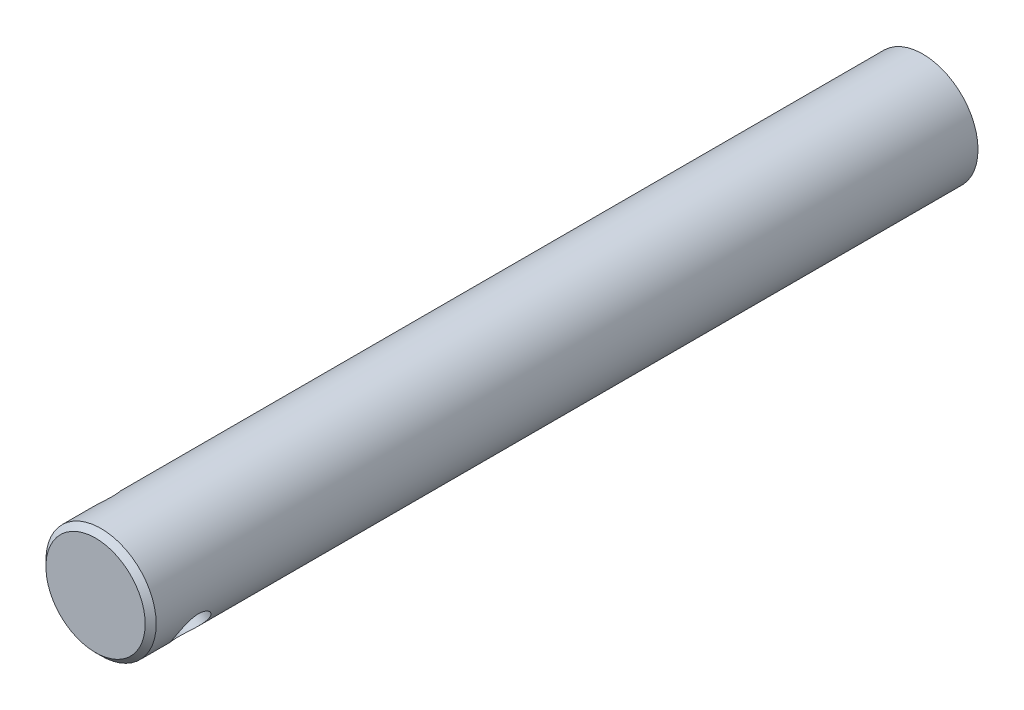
from build123d import *

# Parameters (mm, degrees)
SKETCH1_R           = 10
BOSS_EXTRUDE1_DEPTH = 150
CUT_EXTRUDE1_DEPTH  = 154.74729745
CHAMFER1_SIZE       = 1


with BuildPart() as part:
    # Sketch1 → Boss-Extrude1 (new body)
    with BuildSketch(Plane.XY):
        Circle(SKETCH1_R)
    extrude(amount=BOSS_EXTRUDE1_DEPTH)

    # Sketch2 → Cut-Extrude1 (cut, through all)
    with BuildSketch(Plane(origin=(-16.408521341, 10.995748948, 0), x_dir=(0, 0, -1), z_dir=(-0.8307222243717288, 0.5566871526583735, 0))):
        with BuildLine():
            ThreePointArc((-137.75, 0), (-141, 3.25), (-144.25, 0))
            Line((-144.25, 0), (-137.75, 0))
        make_face()
        with BuildLine():
            Line((-137.75, 0), (-144.25, 0))
            ThreePointArc((-144.25, 0), (-141, -3.25), (-137.75, 0))
        make_face()
        with BuildLine():
            ThreePointArc((-137.75, 0), (-141, 3.25), (-144.25, 0))
            Line((-144.25, 0), (-137.75, 0))
        make_face()
        with BuildLine():
            Line((-137.75, 0), (-144.25, 0))
            ThreePointArc((-144.25, 0), (-141, -3.25), (-137.75, 0))
        make_face()
    extrude(amount=-CUT_EXTRUDE1_DEPTH, mode=Mode.SUBTRACT)

    # Chamfer1
    chamfer1_edges = [part.edges().sort_by_distance(p)[0] for p in [
        (-10, 0, 150),
    ]]
    chamfer(chamfer1_edges, length=CHAMFER1_SIZE)


solid = part.part
